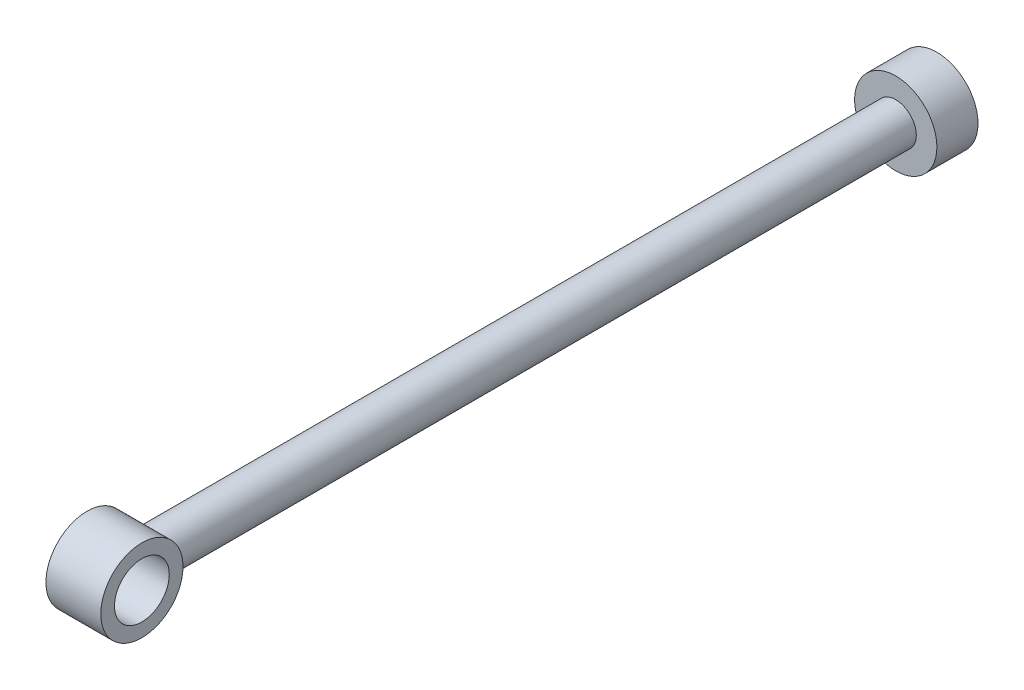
from build123d import *

# Parameters (mm, degrees)
SZKIC1_R                    = 30
DODANIE_WYCI_GNI_CIE1_DEPTH = 30
SZKIC2_R                    = 15
DODANIE_WYCI_GNI_CIE2_DEPTH = 545
SZKIC3_R                    = 30
SZKIC3_R_2                  = 20
DODANIE_WYCI_GNI_CIE3_DEPTH = 20


with BuildPart() as part:
    # Szkic1 → Dodanie-wyci_gni_cie1 (new body)
    with BuildSketch(Plane.XY):
        Circle(SZKIC1_R)
    extrude(amount=DODANIE_WYCI_GNI_CIE1_DEPTH)

    # Szkic2 → Dodanie-wyci_gni_cie2 (add)
    with BuildSketch(Plane.XY.offset(30)):
        Circle(SZKIC2_R)
    extrude(amount=DODANIE_WYCI_GNI_CIE2_DEPTH)

    # Szkic3 → Dodanie-wyci_gni_cie3 (add, symmetric)
    with BuildSketch(Plane(origin=(0, 0, 0), x_dir=(0, 0, -1), z_dir=(1, 0, 0))):
        with Locations((-600, 0)):
            Circle(SZKIC3_R)
        with Locations((-600, 0)):
            Circle(SZKIC3_R_2, mode=Mode.SUBTRACT)
    extrude(amount=DODANIE_WYCI_GNI_CIE3_DEPTH, both=True)


solid = part.part
